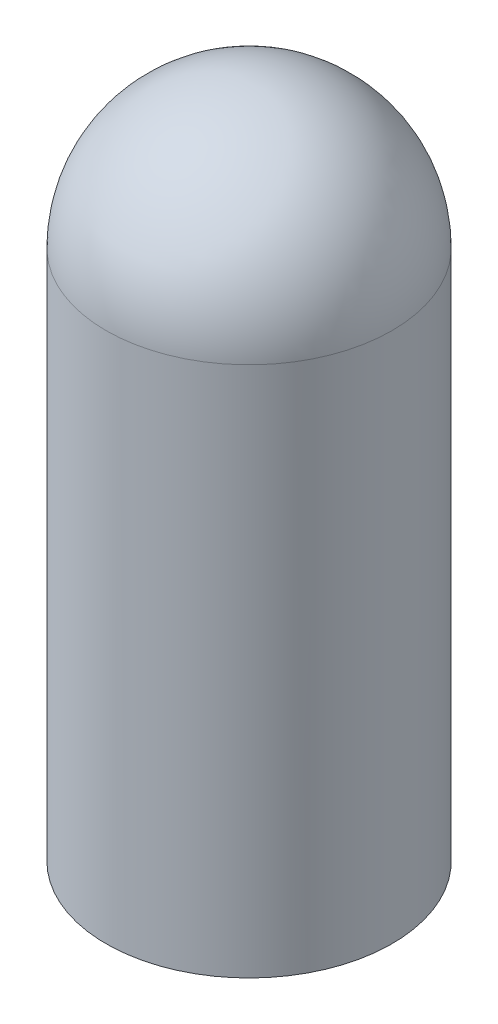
ISO-10303-21;
HEADER;
FILE_DESCRIPTION(('STEP AP214'),'2;1');
FILE_NAME('part.step','',(''),(''),'','','');
FILE_SCHEMA(('AUTOMOTIVE_DESIGN { 1 0 10303 214 1 1 1 1 }'));
ENDSEC;
DATA;
#1=APPLICATION_CONTEXT('core data for automotive mechanical design processes');
#2=APPLICATION_PROTOCOL_DEFINITION('international standard','automotive_design',2000,#1);
#3=PRODUCT_CONTEXT('',#1,'mechanical');
#4=PRODUCT('Part','Part','',(#3));
#5=PRODUCT_RELATED_PRODUCT_CATEGORY('part','',(#4));
#6=PRODUCT_DEFINITION_FORMATION('','',#4);
#7=PRODUCT_DEFINITION_CONTEXT('part definition',#1,'design');
#8=PRODUCT_DEFINITION('design','',#6,#7);
#9=PRODUCT_DEFINITION_SHAPE('','',#8);
#10=(LENGTH_UNIT() NAMED_UNIT(*) SI_UNIT(.MILLI.,.METRE.));
#11=(NAMED_UNIT(*) PLANE_ANGLE_UNIT() SI_UNIT($,.RADIAN.));
#12=(NAMED_UNIT(*) SI_UNIT($,.STERADIAN.) SOLID_ANGLE_UNIT());
#13=UNCERTAINTY_MEASURE_WITH_UNIT(LENGTH_MEASURE(1.E-05),#10,'distance_accuracy_value','');
#14=(GEOMETRIC_REPRESENTATION_CONTEXT(3) GLOBAL_UNCERTAINTY_ASSIGNED_CONTEXT((#13)) GLOBAL_UNIT_ASSIGNED_CONTEXT((#10,
#11,#12)) REPRESENTATION_CONTEXT('',''));
#15=CARTESIAN_POINT('',(0.,0.,0.));
#16=DIRECTION('',(0.,0.,1.));
#17=DIRECTION('',(1.,0.,0.));
#18=AXIS2_PLACEMENT_3D('',#15,#16,#17);
#19=CARTESIAN_POINT('',(8.89,0.,0.));
#20=DIRECTION('',(0.,-1.,0.));
#21=DIRECTION('',(0.,0.,-1.));
#22=AXIS2_PLACEMENT_3D('',#19,#20,#21);
#23=PLANE('',#22);
#24=CARTESIAN_POINT('',(0.,0.,0.));
#25=DIRECTION('',(0.,-1.,0.));
#26=DIRECTION('',(0.,0.,-1.));
#27=AXIS2_PLACEMENT_3D('',#24,#25,#26);
#28=CIRCLE('',#27,8.89);
#29=CARTESIAN_POINT('',(0.,0.,-8.89));
#30=VERTEX_POINT('',#29);
#31=EDGE_CURVE('E10',#30,#30,#28,.T.);
#32=ORIENTED_EDGE('',*,*,#31,.T.);
#33=EDGE_LOOP('',(#32));
#34=FACE_BOUND('',#33,.T.);
#35=ADVANCED_FACE('F28',(#34),#23,.T.);
#36=CARTESIAN_POINT('',(0.,0.,0.));
#37=DIRECTION('',(0.,-1.,0.));
#38=DIRECTION('',(0.,0.,-1.));
#39=AXIS2_PLACEMENT_3D('',#36,#37,#38);
#40=CYLINDRICAL_SURFACE('',#39,8.89);
#41=CARTESIAN_POINT('',(0.,33.02,0.));
#42=DIRECTION('',(0.,-1.,0.));
#43=DIRECTION('',(0.,0.,-1.));
#44=AXIS2_PLACEMENT_3D('',#41,#42,#43);
#45=CIRCLE('',#44,8.89);
#46=CARTESIAN_POINT('',(0.,33.02,-8.89));
#47=VERTEX_POINT('',#46);
#48=EDGE_CURVE('E34',#47,#47,#45,.T.);
#49=ORIENTED_EDGE('',*,*,#48,.T.);
#50=EDGE_LOOP('',(#49));
#51=FACE_BOUND('',#50,.T.);
#52=ORIENTED_EDGE('',*,*,#31,.F.);
#53=EDGE_LOOP('',(#52));
#54=FACE_BOUND('',#53,.T.);
#55=ADVANCED_FACE('F40',(#51,#54),#40,.T.);
#56=CARTESIAN_POINT('',(0.,33.02,0.));
#57=DIRECTION('',(0.,-1.,0.));
#58=DIRECTION('',(1.,0.,0.));
#59=AXIS2_PLACEMENT_3D('',#56,#57,#58);
#60=SPHERICAL_SURFACE('',#59,8.89);
#61=ORIENTED_EDGE('',*,*,#48,.F.);
#62=EDGE_LOOP('',(#61));
#63=FACE_BOUND('',#62,.T.);
#64=ADVANCED_FACE('F43',(#63),#60,.T.);
#65=CLOSED_SHELL('',(#35,#55,#64));
#66=MANIFOLD_SOLID_BREP('B2',#65);
#67=ADVANCED_BREP_SHAPE_REPRESENTATION('',(#18,#66),#14);
#68=SHAPE_DEFINITION_REPRESENTATION(#9,#67);
ENDSEC;
END-ISO-10303-21;
